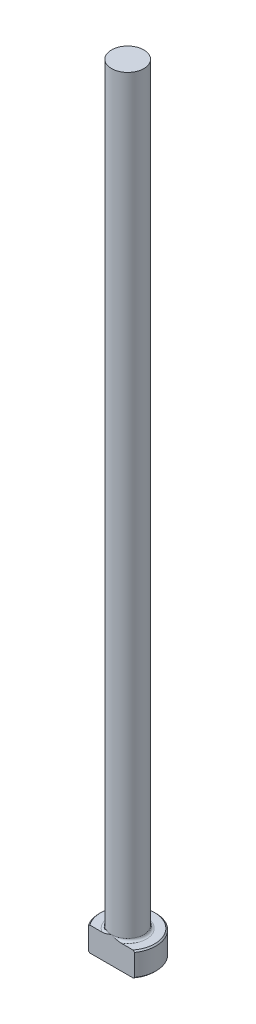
ISO-10303-21;
HEADER;
FILE_DESCRIPTION(('STEP AP214'),'2;1');
FILE_NAME('part.step','',(''),(''),'','','');
FILE_SCHEMA(('AUTOMOTIVE_DESIGN { 1 0 10303 214 1 1 1 1 }'));
ENDSEC;
DATA;
#1=APPLICATION_CONTEXT('core data for automotive mechanical design processes');
#2=APPLICATION_PROTOCOL_DEFINITION('international standard','automotive_design',2000,#1);
#3=PRODUCT_CONTEXT('',#1,'mechanical');
#4=PRODUCT('Part','Part','',(#3));
#5=PRODUCT_RELATED_PRODUCT_CATEGORY('part','',(#4));
#6=PRODUCT_DEFINITION_FORMATION('','',#4);
#7=PRODUCT_DEFINITION_CONTEXT('part definition',#1,'design');
#8=PRODUCT_DEFINITION('design','',#6,#7);
#9=PRODUCT_DEFINITION_SHAPE('','',#8);
#10=(LENGTH_UNIT() NAMED_UNIT(*) SI_UNIT(.MILLI.,.METRE.));
#11=(NAMED_UNIT(*) PLANE_ANGLE_UNIT() SI_UNIT($,.RADIAN.));
#12=(NAMED_UNIT(*) SI_UNIT($,.STERADIAN.) SOLID_ANGLE_UNIT());
#13=UNCERTAINTY_MEASURE_WITH_UNIT(LENGTH_MEASURE(1.E-05),#10,'distance_accuracy_value','');
#14=(GEOMETRIC_REPRESENTATION_CONTEXT(3) GLOBAL_UNCERTAINTY_ASSIGNED_CONTEXT((#13)) GLOBAL_UNIT_ASSIGNED_CONTEXT((#10,
#11,#12)) REPRESENTATION_CONTEXT('',''));
#15=CARTESIAN_POINT('',(0.,0.,0.));
#16=DIRECTION('',(0.,0.,1.));
#17=DIRECTION('',(1.,0.,0.));
#18=AXIS2_PLACEMENT_3D('',#15,#16,#17);
#19=CARTESIAN_POINT('',(0.,0.,0.));
#20=DIRECTION('',(0.,-1.,0.));
#21=DIRECTION('',(0.,0.,-1.));
#22=AXIS2_PLACEMENT_3D('',#19,#20,#21);
#23=PLANE('',#22);
#24=CARTESIAN_POINT('',(0.,0.,0.));
#25=DIRECTION('',(0.,-1.,0.));
#26=DIRECTION('',(0.,0.,-1.));
#27=AXIS2_PLACEMENT_3D('',#24,#25,#26);
#28=CIRCLE('',#27,5.29589999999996);
#29=CARTESIAN_POINT('',(-4.23862381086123,0.,3.17499999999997));
#30=VERTEX_POINT('',#29);
#31=CARTESIAN_POINT('',(4.23862381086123,0.,3.17499999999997));
#32=VERTEX_POINT('',#31);
#33=EDGE_CURVE('E98',#30,#32,#28,.T.);
#34=ORIENTED_EDGE('',*,*,#33,.T.);
#35=DIRECTION('',(-1.,0.,0.));
#36=VECTOR('',#35,1.);
#37=CARTESIAN_POINT('',(-4.55200670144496,0.,3.17499999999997));
#38=LINE('',#37,#36);
#39=EDGE_CURVE('E83',#32,#30,#38,.T.);
#40=ORIENTED_EDGE('',*,*,#39,.T.);
#41=EDGE_LOOP('',(#34,#40));
#42=FACE_BOUND('',#41,.T.);
#43=ADVANCED_FACE('F32',(#42),#23,.T.);
#44=CARTESIAN_POINT('',(0.,259.958771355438,0.));
#45=DIRECTION('',(0.,1.,0.));
#46=DIRECTION('',(0.,0.,1.));
#47=AXIS2_PLACEMENT_3D('',#44,#45,#46);
#48=CYLINDRICAL_SURFACE('',#47,5.54989999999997);
#49=CARTESIAN_POINT('',(0.,4.49579999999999,0.));
#50=DIRECTION('',(0.,1.,0.));
#51=DIRECTION('',(0.,0.,1.));
#52=AXIS2_PLACEMENT_3D('',#49,#50,#51);
#53=CIRCLE('',#52,5.54989999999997);
#54=CARTESIAN_POINT('',(-4.55200670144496,4.49579999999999,3.17499999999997));
#55=VERTEX_POINT('',#54);
#56=CARTESIAN_POINT('',(4.55200670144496,4.49579999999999,3.17499999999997));
#57=VERTEX_POINT('',#56);
#58=EDGE_CURVE('E104',#55,#57,#53,.F.);
#59=ORIENTED_EDGE('',*,*,#58,.T.);
#60=DIRECTION('',(0.,-1.,0.));
#61=VECTOR('',#60,1.);
#62=CARTESIAN_POINT('',(4.55200670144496,152.4,3.17499999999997));
#63=LINE('',#62,#61);
#64=CARTESIAN_POINT('',(4.55200670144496,0.253999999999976,3.17499999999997));
#65=VERTEX_POINT('',#64);
#66=EDGE_CURVE('E183',#57,#65,#63,.T.);
#67=ORIENTED_EDGE('',*,*,#66,.T.);
#68=CARTESIAN_POINT('',(0.,0.253999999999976,0.));
#69=DIRECTION('',(0.,-1.,0.));
#70=DIRECTION('',(0.,0.,-1.));
#71=AXIS2_PLACEMENT_3D('',#68,#69,#70);
#72=CIRCLE('',#71,5.54989999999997);
#73=CARTESIAN_POINT('',(-4.55200670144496,0.253999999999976,3.17499999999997));
#74=VERTEX_POINT('',#73);
#75=EDGE_CURVE('E100',#65,#74,#72,.F.);
#76=ORIENTED_EDGE('',*,*,#75,.T.);
#77=DIRECTION('',(0.,-1.,0.));
#78=VECTOR('',#77,1.);
#79=CARTESIAN_POINT('',(-4.55200670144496,152.4,3.17499999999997));
#80=LINE('',#79,#78);
#81=EDGE_CURVE('E93',#55,#74,#80,.T.);
#82=ORIENTED_EDGE('',*,*,#81,.F.);
#83=EDGE_LOOP('',(#59,#67,#76,#82));
#84=FACE_BOUND('',#83,.T.);
#85=ADVANCED_FACE('F158',(#84),#48,.T.);
#86=CARTESIAN_POINT('',(-5.54989999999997,4.7498,0.));
#87=DIRECTION('',(0.,1.,0.));
#88=DIRECTION('',(0.,0.,1.));
#89=AXIS2_PLACEMENT_3D('',#86,#87,#88);
#90=PLANE('',#89);
#91=CARTESIAN_POINT('',(0.,4.7498,0.));
#92=DIRECTION('',(0.,1.,0.));
#93=DIRECTION('',(0.,0.,1.));
#94=AXIS2_PLACEMENT_3D('',#91,#92,#93);
#95=CIRCLE('',#94,5.29589999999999);
#96=CARTESIAN_POINT('',(4.23862381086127,4.7498,3.17499999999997));
#97=VERTEX_POINT('',#96);
#98=CARTESIAN_POINT('',(-4.23862381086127,4.7498,3.17499999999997));
#99=VERTEX_POINT('',#98);
#100=EDGE_CURVE('E178',#97,#99,#95,.T.);
#101=ORIENTED_EDGE('',*,*,#100,.T.);
#102=DIRECTION('',(1.,0.,0.));
#103=VECTOR('',#102,1.);
#104=CARTESIAN_POINT('',(-5.54989999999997,4.7498,3.17499999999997));
#105=LINE('',#104,#103);
#106=CARTESIAN_POINT('',(-1.86651118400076,4.74979999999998,3.17499999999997));
#107=VERTEX_POINT('',#106);
#108=EDGE_CURVE('E57',#99,#107,#105,.T.);
#109=ORIENTED_EDGE('',*,*,#108,.T.);
#110=CARTESIAN_POINT('',(0.,4.7498,0.));
#111=DIRECTION('',(0.,1.,0.));
#112=DIRECTION('',(0.,0.,1.));
#113=AXIS2_PLACEMENT_3D('',#110,#111,#112);
#114=CIRCLE('',#113,3.68299999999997);
#115=CARTESIAN_POINT('',(1.86651118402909,4.74979999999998,3.17499999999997));
#116=VERTEX_POINT('',#115);
#117=EDGE_CURVE('E107',#107,#116,#114,.F.);
#118=ORIENTED_EDGE('',*,*,#117,.T.);
#119=EDGE_CURVE('E136',#116,#97,#105,.T.);
#120=ORIENTED_EDGE('',*,*,#119,.T.);
#121=EDGE_LOOP('',(#101,#109,#118,#120));
#122=FACE_BOUND('',#121,.T.);
#123=ADVANCED_FACE('F147',(#122),#90,.T.);
#124=CARTESIAN_POINT('',(0.,4.74980000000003,0.));
#125=DIRECTION('',(0.,-1.,0.));
#126=DIRECTION('',(0.,0.,-1.));
#127=AXIS2_PLACEMENT_3D('',#124,#125,#126);
#128=CONICAL_SURFACE('',#127,5.29589999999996,0.785398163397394);
#129=ORIENTED_EDGE('',*,*,#58,.F.);
#130=CARTESIAN_POINT('',(-10.0167402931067,-0.462188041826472,3.17499999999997));
#131=CARTESIAN_POINT('',(-9.83956615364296,-0.293299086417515,3.17499999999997));
#132=CARTESIAN_POINT('',(-9.66219175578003,-0.12462001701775,3.17499999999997));
#133=CARTESIAN_POINT('',(-9.3069644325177,0.212235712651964,3.17499999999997));
#134=CARTESIAN_POINT('',(-9.12911150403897,0.38041236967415,3.17499999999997));
#135=CARTESIAN_POINT('',(-8.59460771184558,0.884168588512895,3.17499999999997));
#136=CARTESIAN_POINT('',(-8.23712475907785,1.2188665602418,3.17499999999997));
#137=CARTESIAN_POINT('',(-7.51548848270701,1.8882077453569,3.17499999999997));
#138=CARTESIAN_POINT('',(-7.15130415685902,2.22281765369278,3.17499999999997));
#139=CARTESIAN_POINT('',(-6.60150494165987,2.72077471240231,3.17499999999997));
#140=CARTESIAN_POINT('',(-6.41766956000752,2.88608479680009,3.17499999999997));
#141=CARTESIAN_POINT('',(-6.04850874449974,3.21502923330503,3.17499999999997));
#142=CARTESIAN_POINT('',(-5.86318332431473,3.37866360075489,3.17499999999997));
#143=CARTESIAN_POINT('',(-5.42475636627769,3.76132794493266,3.17499999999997));
#144=CARTESIAN_POINT('',(-5.17087613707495,3.97947167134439,3.17499999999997));
#145=CARTESIAN_POINT('',(-4.78637219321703,4.3024257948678,3.17499999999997));
#146=CARTESIAN_POINT('',(-4.65755933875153,4.40939174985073,3.17499999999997));
#147=CARTESIAN_POINT('',(-4.39846835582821,4.62153187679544,3.17499999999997));
#148=CARTESIAN_POINT('',(-4.26819026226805,4.72670609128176,3.17499999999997));
#149=CARTESIAN_POINT('',(-4.00614386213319,4.93458819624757,3.17499999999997));
#150=CARTESIAN_POINT('',(-3.87437946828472,5.03730100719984,3.17499999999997));
#151=CARTESIAN_POINT('',(-3.60868880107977,5.23988426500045,3.17499999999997));
#152=CARTESIAN_POINT('',(-3.47476266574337,5.33975489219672,3.17499999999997));
#153=CARTESIAN_POINT('',(-3.2043256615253,5.53575009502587,3.17499999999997));
#154=CARTESIAN_POINT('',(-3.0678166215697,5.63187718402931,3.17499999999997));
#155=CARTESIAN_POINT('',(-2.7915074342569,5.81925786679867,3.17499999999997));
#156=CARTESIAN_POINT('',(-2.65170798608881,5.91051248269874,3.17499999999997));
#157=CARTESIAN_POINT('',(-2.40080357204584,6.06610461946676,3.17499999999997));
#158=CARTESIAN_POINT('',(-2.2905364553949,6.13178781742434,3.17499999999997));
#159=CARTESIAN_POINT('',(-2.06714717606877,6.2581898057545,3.17499999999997));
#160=CARTESIAN_POINT('',(-1.9540245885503,6.31890785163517,3.17499999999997));
#161=CARTESIAN_POINT('',(-1.724636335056,6.43389240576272,3.17499999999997));
#162=CARTESIAN_POINT('',(-1.60837338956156,6.48816429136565,3.17499999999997));
#163=CARTESIAN_POINT('',(-1.3723248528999,6.5884611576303,3.17499999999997));
#164=CARTESIAN_POINT('',(-1.25254039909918,6.63448876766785,3.17499999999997));
#165=CARTESIAN_POINT('',(-1.03847127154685,6.70631999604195,3.17499999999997));
#166=CARTESIAN_POINT('',(-0.944930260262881,6.73432823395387,3.17499999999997));
#167=CARTESIAN_POINT('',(-0.756011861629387,6.7832065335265,3.17499999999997));
#168=CARTESIAN_POINT('',(-0.660635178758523,6.80407927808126,3.17499999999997));
#169=CARTESIAN_POINT('',(-0.468752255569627,6.83766834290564,3.17499999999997));
#170=CARTESIAN_POINT('',(-0.37225064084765,6.85041070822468,3.17499999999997));
#171=CARTESIAN_POINT('',(-0.178484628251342,6.86715141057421,3.17499999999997));
#172=CARTESIAN_POINT('',(-0.0812202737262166,6.8711502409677,3.17499999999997));
#173=CARTESIAN_POINT('',(0.113557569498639,6.87016742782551,3.17499999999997));
#174=CARTESIAN_POINT('',(0.211070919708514,6.86515852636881,3.17499999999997));
#175=CARTESIAN_POINT('',(0.405245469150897,6.84640245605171,3.17499999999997));
#176=CARTESIAN_POINT('',(0.501906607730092,6.83265467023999,3.17499999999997));
#177=CARTESIAN_POINT('',(0.694033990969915,6.79710670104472,3.17499999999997));
#178=CARTESIAN_POINT('',(0.789495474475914,6.7752811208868,3.17499999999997));
#179=CARTESIAN_POINT('',(0.978501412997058,6.72458544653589,3.17499999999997));
#180=CARTESIAN_POINT('',(1.07204574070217,6.69571488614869,3.17499999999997));
#181=CARTESIAN_POINT('',(1.36820011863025,6.59374975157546,3.17499999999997));
#182=CARTESIAN_POINT('',(1.56688529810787,6.50918166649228,3.17499999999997));
#183=CARTESIAN_POINT('',(1.85781194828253,6.36807703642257,3.17499999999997));
#184=CARTESIAN_POINT('',(1.95370879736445,6.31860244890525,3.17499999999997));
#185=CARTESIAN_POINT('',(2.14339771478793,6.21576230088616,3.17499999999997));
#186=CARTESIAN_POINT('',(2.23719011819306,6.16239736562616,3.17499999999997));
#187=CARTESIAN_POINT('',(2.42421725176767,6.05174311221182,3.17499999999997));
#188=CARTESIAN_POINT('',(2.51742507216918,5.99440876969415,3.17499999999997));
#189=CARTESIAN_POINT('',(2.70216375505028,5.87710026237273,3.17499999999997));
#190=CARTESIAN_POINT('',(2.79369457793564,5.81712603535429,3.17499999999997));
#191=CARTESIAN_POINT('',(2.97520639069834,5.6950712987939,3.17499999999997));
#192=CARTESIAN_POINT('',(3.06518880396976,5.63299289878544,3.17499999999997));
#193=CARTESIAN_POINT('',(3.24388392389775,5.50704415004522,3.17499999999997));
#194=CARTESIAN_POINT('',(3.33259666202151,5.44317384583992,3.17499999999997));
#195=CARTESIAN_POINT('',(3.57597346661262,5.26479758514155,3.17499999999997));
#196=CARTESIAN_POINT('',(3.72948709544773,5.1487222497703,3.17499999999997));
#197=CARTESIAN_POINT('',(4.03385257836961,4.91312427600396,3.17499999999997));
#198=CARTESIAN_POINT('',(4.18470417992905,4.79360131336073,3.17499999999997));
#199=CARTESIAN_POINT('',(4.48432539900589,4.55188905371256,3.17499999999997));
#200=CARTESIAN_POINT('',(4.63309438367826,4.42969897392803,3.17499999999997));
#201=CARTESIAN_POINT('',(4.92891951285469,4.18325994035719,3.17499999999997));
#202=CARTESIAN_POINT('',(5.07597561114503,4.05901093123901,3.17499999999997));
#203=CARTESIAN_POINT('',(5.51556942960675,3.68340723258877,3.17499999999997));
#204=CARTESIAN_POINT('',(5.80602157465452,3.42961335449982,3.17499999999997));
#205=CARTESIAN_POINT('',(6.38307996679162,2.91781719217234,3.17499999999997));
#206=CARTESIAN_POINT('',(6.66968688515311,2.65981566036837,3.17499999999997));
#207=CARTESIAN_POINT('',(7.2137512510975,2.16488107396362,3.17499999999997));
#208=CARTESIAN_POINT('',(7.47144859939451,1.92821133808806,3.17499999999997));
#209=CARTESIAN_POINT('',(7.98516371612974,1.45303114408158,3.17499999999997));
#210=CARTESIAN_POINT('',(8.24118139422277,1.2145205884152,3.17499999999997));
#211=CARTESIAN_POINT('',(8.75104638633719,0.736915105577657,3.17499999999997));
#212=CARTESIAN_POINT('',(9.00489811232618,0.497824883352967,3.17499999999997));
#213=CARTESIAN_POINT('',(9.51154344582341,0.0185627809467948,3.17499999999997));
#214=CARTESIAN_POINT('',(9.76433712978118,-0.221609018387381,3.17499999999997));
#215=CARTESIAN_POINT('',(10.0167402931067,-0.462188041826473,3.17499999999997));
#216=B_SPLINE_CURVE_WITH_KNOTS('',3,(#130,#131,#132,#133,#134,#135,#136,#137,#138,#139,#140,
#141,#142,#143,#144,#145,#146,#147,#148,#149,#150,#151,#152,#153,#154,#155,#156,#157,#158,#159,
#160,#161,#162,#163,#164,#165,#166,#167,#168,#169,#170,#171,#172,#173,#174,#175,#176,#177,#178,
#179,#180,#181,#182,#183,#184,#185,#186,#187,#188,#189,#190,#191,#192,#193,#194,#195,#196,#197,
#198,#199,#200,#201,#202,#203,#204,#205,#206,#207,#208,#209,#210,#211,#212,#213,#214,#215),
.UNSPECIFIED.,.F.,.F.,(4,2,2,2,2,2,2,2,2,2,2,2,2,2,2,2,2,2,2,2,2,2,2,2,2,2,2,2,2,2,2,2,2,2,2,2,
2,2,2,2,2,2,4),(0.,0.734320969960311,1.46864667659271,2.93776649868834,4.42142163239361,
5.16310419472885,5.90477996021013,6.90888979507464,7.41118265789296,7.9134635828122,
8.41463858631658,8.91578171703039,9.41658237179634,9.91727755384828,10.3022224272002,
10.68722491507,11.0719039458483,11.4564600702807,11.7491569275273,12.0417436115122,
12.3333882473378,12.6250164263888,12.9175285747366,13.2100613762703,13.5035218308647,
13.797001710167,14.4429112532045,14.7666018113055,15.0902404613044,15.4184826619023,
15.7467326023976,16.0746626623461,16.4025845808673,16.9798839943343,17.5572378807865,
18.1347635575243,18.7123047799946,19.8693665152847,21.0262235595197,22.0758708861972,
23.1255742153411,24.1717271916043,25.2178032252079),.UNSPECIFIED.);
#217=EDGE_CURVE('E135',#55,#99,#216,.T.);
#218=ORIENTED_EDGE('',*,*,#217,.T.);
#219=ORIENTED_EDGE('',*,*,#100,.F.);
#220=EDGE_CURVE('E127',#97,#57,#216,.T.);
#221=ORIENTED_EDGE('',*,*,#220,.T.);
#222=EDGE_LOOP('',(#129,#218,#219,#221));
#223=FACE_BOUND('',#222,.T.);
#224=ADVANCED_FACE('F143',(#223),#128,.T.);
#225=CARTESIAN_POINT('',(0.,0.253999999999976,0.));
#226=DIRECTION('',(0.,1.,0.));
#227=DIRECTION('',(0.,0.,1.));
#228=AXIS2_PLACEMENT_3D('',#225,#226,#227);
#229=CONICAL_SURFACE('',#228,5.54989999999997,0.785398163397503);
#230=ORIENTED_EDGE('',*,*,#75,.F.);
#231=CARTESIAN_POINT('',(10.0167402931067,5.21198804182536,3.17499999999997));
#232=CARTESIAN_POINT('',(9.83956615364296,5.04309908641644,3.17499999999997));
#233=CARTESIAN_POINT('',(9.66219175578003,4.87442001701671,3.17499999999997));
#234=CARTESIAN_POINT('',(9.3069644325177,4.53756428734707,3.17499999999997));
#235=CARTESIAN_POINT('',(9.12911150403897,4.36938763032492,3.17499999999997));
#236=CARTESIAN_POINT('',(8.59460771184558,3.86563141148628,3.17499999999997));
#237=CARTESIAN_POINT('',(8.23712475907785,3.53093343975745,3.17499999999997));
#238=CARTESIAN_POINT('',(7.515488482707,2.8615922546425,3.17499999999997));
#239=CARTESIAN_POINT('',(7.15130415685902,2.5269823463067,3.17499999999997));
#240=CARTESIAN_POINT('',(6.60150494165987,2.02902528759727,3.17499999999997));
#241=CARTESIAN_POINT('',(6.41766956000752,1.86371520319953,3.17499999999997));
#242=CARTESIAN_POINT('',(6.04850874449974,1.53477076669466,3.17499999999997));
#243=CARTESIAN_POINT('',(5.86318332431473,1.37113639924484,3.17499999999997));
#244=CARTESIAN_POINT('',(5.42475636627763,0.988472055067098,3.17499999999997));
#245=CARTESIAN_POINT('',(5.17087613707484,0.770328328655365,3.17499999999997));
#246=CARTESIAN_POINT('',(4.78637219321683,0.447374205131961,3.17499999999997));
#247=CARTESIAN_POINT('',(4.65755933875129,0.340408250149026,3.17499999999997));
#248=CARTESIAN_POINT('',(4.39846835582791,0.128268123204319,3.17499999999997));
#249=CARTESIAN_POINT('',(4.26819026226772,0.0230939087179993,3.17499999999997));
#250=CARTESIAN_POINT('',(4.0061438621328,-0.184788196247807,3.17499999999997));
#251=CARTESIAN_POINT('',(3.8743794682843,-0.287501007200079,3.17499999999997));
#252=CARTESIAN_POINT('',(3.60868880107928,-0.490084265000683,3.17499999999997));
#253=CARTESIAN_POINT('',(3.47476266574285,-0.589954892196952,3.17499999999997));
#254=CARTESIAN_POINT('',(3.20432566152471,-0.785950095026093,3.17499999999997));
#255=CARTESIAN_POINT('',(3.06781662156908,-0.882077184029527,3.17499999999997));
#256=CARTESIAN_POINT('',(2.79150743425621,-1.06945786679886,3.17499999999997));
#257=CARTESIAN_POINT('',(2.65170798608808,-1.16071248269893,3.17499999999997));
#258=CARTESIAN_POINT('',(2.40080357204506,-1.31630461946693,3.17499999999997));
#259=CARTESIAN_POINT('',(2.29053645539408,-1.38198781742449,3.17499999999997));
#260=CARTESIAN_POINT('',(2.0671471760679,-1.50838980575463,3.17499999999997));
#261=CARTESIAN_POINT('',(1.95402458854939,-1.56910785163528,3.17499999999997));
#262=CARTESIAN_POINT('',(1.72463633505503,-1.68409240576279,3.17499999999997));
#263=CARTESIAN_POINT('',(1.60837338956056,-1.7383642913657,3.17499999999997));
#264=CARTESIAN_POINT('',(1.37232485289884,-1.83866115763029,3.17499999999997));
#265=CARTESIAN_POINT('',(1.25254039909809,-1.88468876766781,3.17499999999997));
#266=CARTESIAN_POINT('',(1.03847127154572,-1.95651999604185,3.17499999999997));
#267=CARTESIAN_POINT('',(0.944930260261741,-1.98452823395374,3.17499999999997));
#268=CARTESIAN_POINT('',(0.756011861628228,-2.0334065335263,3.17499999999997));
#269=CARTESIAN_POINT('',(0.660635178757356,-2.05427927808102,3.17499999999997));
#270=CARTESIAN_POINT('',(0.468752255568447,-2.08786834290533,3.17499999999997));
#271=CARTESIAN_POINT('',(0.372250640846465,-2.10061070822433,3.17499999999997));
#272=CARTESIAN_POINT('',(0.178484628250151,-2.11735141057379,3.17499999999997));
#273=CARTESIAN_POINT('',(0.0812202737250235,-2.12135024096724,3.17499999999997));
#274=CARTESIAN_POINT('',(-0.113557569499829,-2.12036742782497,3.17499999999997));
#275=CARTESIAN_POINT('',(-0.2110709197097,-2.11535852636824,3.17499999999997));
#276=CARTESIAN_POINT('',(-0.405245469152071,-2.09660245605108,3.17499999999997));
#277=CARTESIAN_POINT('',(-0.50190660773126,-2.08285467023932,3.17499999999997));
#278=CARTESIAN_POINT('',(-0.694033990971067,-2.047306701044,3.17499999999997));
#279=CARTESIAN_POINT('',(-0.789495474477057,-2.02548112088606,3.17499999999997));
#280=CARTESIAN_POINT('',(-0.978501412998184,-1.9747854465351,3.17499999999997));
#281=CARTESIAN_POINT('',(-1.07204574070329,-1.94591488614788,3.17499999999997));
#282=CARTESIAN_POINT('',(-1.36820011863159,-1.84394975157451,3.17499999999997));
#283=CARTESIAN_POINT('',(-1.56688529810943,-1.75938166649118,3.17499999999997));
#284=CARTESIAN_POINT('',(-1.85781194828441,-1.61827703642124,3.17499999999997));
#285=CARTESIAN_POINT('',(-1.95370879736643,-1.56880244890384,3.17499999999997));
#286=CARTESIAN_POINT('',(-2.14339771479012,-1.46596230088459,3.17499999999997));
#287=CARTESIAN_POINT('',(-2.23719011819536,-1.41259736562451,3.17499999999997));
#288=CARTESIAN_POINT('',(-2.42421725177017,-1.30194311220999,3.17499999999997));
#289=CARTESIAN_POINT('',(-2.51742507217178,-1.24460876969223,3.17499999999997));
#290=CARTESIAN_POINT('',(-2.70216375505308,-1.12730026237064,3.17499999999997));
#291=CARTESIAN_POINT('',(-2.79369457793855,-1.06732603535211,3.17499999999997));
#292=CARTESIAN_POINT('',(-2.97520639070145,-0.945271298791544,3.17499999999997));
#293=CARTESIAN_POINT('',(-3.06518880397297,-0.883192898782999,3.17499999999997));
#294=CARTESIAN_POINT('',(-3.24388392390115,-0.757244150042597,3.17499999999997));
#295=CARTESIAN_POINT('',(-3.33259666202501,-0.69337384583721,3.17499999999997));
#296=CARTESIAN_POINT('',(-3.57597346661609,-0.514997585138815,3.17499999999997));
#297=CARTESIAN_POINT('',(-3.72948709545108,-0.398922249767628,3.17499999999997));
#298=CARTESIAN_POINT('',(-4.03385257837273,-0.16332427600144,3.17499999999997));
#299=CARTESIAN_POINT('',(-4.18470417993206,-0.0438013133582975,3.17499999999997));
#300=CARTESIAN_POINT('',(-4.48432539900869,0.197910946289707,3.17499999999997));
#301=CARTESIAN_POINT('',(-4.63309438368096,0.320101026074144,3.17499999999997));
#302=CARTESIAN_POINT('',(-4.92891951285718,0.566540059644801,3.17499999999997));
#303=CARTESIAN_POINT('',(-5.07597561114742,0.690789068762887,3.17499999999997));
#304=CARTESIAN_POINT('',(-5.51556942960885,1.06639276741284,3.17499999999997));
#305=CARTESIAN_POINT('',(-5.80602157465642,1.32018664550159,3.17499999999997));
#306=CARTESIAN_POINT('',(-6.38307996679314,1.83198280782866,3.17499999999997));
#307=CARTESIAN_POINT('',(-6.66968688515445,2.08998433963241,3.17499999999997));
#308=CARTESIAN_POINT('',(-7.21375125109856,2.58491892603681,3.17499999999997));
#309=CARTESIAN_POINT('',(-7.47144859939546,2.82158866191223,3.17499999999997));
#310=CARTESIAN_POINT('',(-7.9851637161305,3.29676885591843,3.17499999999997));
#311=CARTESIAN_POINT('',(-8.24118139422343,3.53527941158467,3.17499999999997));
#312=CARTESIAN_POINT('',(-8.75104638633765,4.01288489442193,3.17499999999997));
#313=CARTESIAN_POINT('',(-9.00489811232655,4.25197511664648,3.17499999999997));
#314=CARTESIAN_POINT('',(-9.51154344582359,4.73123721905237,3.17499999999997));
#315=CARTESIAN_POINT('',(-9.76433712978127,4.97140901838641,3.17499999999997));
#316=CARTESIAN_POINT('',(-10.0167402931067,5.21198804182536,3.17499999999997));
#317=B_SPLINE_CURVE_WITH_KNOTS('',3,(#231,#232,#233,#234,#235,#236,#237,#238,#239,#240,#241,
#242,#243,#244,#245,#246,#247,#248,#249,#250,#251,#252,#253,#254,#255,#256,#257,#258,#259,#260,
#261,#262,#263,#264,#265,#266,#267,#268,#269,#270,#271,#272,#273,#274,#275,#276,#277,#278,#279,
#280,#281,#282,#283,#284,#285,#286,#287,#288,#289,#290,#291,#292,#293,#294,#295,#296,#297,#298,
#299,#300,#301,#302,#303,#304,#305,#306,#307,#308,#309,#310,#311,#312,#313,#314,#315,#316),
.UNSPECIFIED.,.F.,.F.,(4,2,2,2,2,2,2,2,2,2,2,2,2,2,2,2,2,2,2,2,2,2,2,2,2,2,2,2,2,2,2,2,2,2,2,2,
2,2,2,2,2,2,4),(0.,0.734320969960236,1.46864667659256,2.93776649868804,4.42142163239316,
5.16310419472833,5.90477996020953,6.90888979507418,7.41118265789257,7.91346358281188,
8.41463858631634,8.91578171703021,9.41658237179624,9.91727755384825,10.3022224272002,
10.68722491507,11.0719039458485,11.4564600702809,11.7491569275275,12.0417436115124,
12.333388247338,12.625016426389,12.9175285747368,13.2100613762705,13.5035218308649,
13.7970017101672,14.4429112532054,14.7666018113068,15.0902404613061,15.4184826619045,
15.7467326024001,16.074662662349,16.4025845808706,16.9798839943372,17.557237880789,
18.1347635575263,18.7123047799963,19.8693665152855,21.0262235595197,22.0758708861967,
23.12557421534,24.1717271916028,25.2178032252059),.UNSPECIFIED.);
#318=EDGE_CURVE('E86',#65,#32,#317,.T.);
#319=ORIENTED_EDGE('',*,*,#318,.T.);
#320=ORIENTED_EDGE('',*,*,#33,.F.);
#321=EDGE_CURVE('E89',#30,#74,#317,.T.);
#322=ORIENTED_EDGE('',*,*,#321,.T.);
#323=EDGE_LOOP('',(#230,#319,#320,#322));
#324=FACE_BOUND('',#323,.T.);
#325=ADVANCED_FACE('F97',(#324),#229,.T.);
#326=CARTESIAN_POINT('',(0.,5.25779999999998,0.));
#327=DIRECTION('',(0.,1.,0.));
#328=DIRECTION('',(0.,0.,1.));
#329=AXIS2_PLACEMENT_3D('',#326,#327,#328);
#330=TOROIDAL_SURFACE('',#329,3.68299999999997,0.508);
#331=CARTESIAN_POINT('',(0.,5.25779999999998,3.17499999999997));
#332=CARTESIAN_POINT('',(1.80769140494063E-10,5.25780081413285,3.17499999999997));
#333=CARTESIAN_POINT('',(1.73023885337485E-07,5.25780162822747,3.17499999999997));
#334=CARTESIAN_POINT('',(7.19628532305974E-07,5.25780319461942,3.17499999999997));
#335=CARTESIAN_POINT('',(1.09883574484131E-06,5.25780394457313,3.17499999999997));
#336=CARTESIAN_POINT('',(2.00966877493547E-06,5.25780544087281,3.17499999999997));
#337=CARTESIAN_POINT('',(2.55212989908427E-06,5.25780618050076,3.17499999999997));
#338=CARTESIAN_POINT('',(3.72136332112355E-06,5.2578075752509,3.17499999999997));
#339=CARTESIAN_POINT('',(4.34736599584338E-06,5.25780823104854,3.17499999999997));
#340=CARTESIAN_POINT('',(6.59438228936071E-06,5.25781043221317,3.17499999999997));
#341=CARTESIAN_POINT('',(8.32481537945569E-06,5.25781186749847,3.17499999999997));
#342=CARTESIAN_POINT('',(1.18988287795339E-05,5.25781442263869,3.17499999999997));
#343=CARTESIAN_POINT('',(1.37358815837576E-05,5.25781555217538,3.17499999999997));
#344=CARTESIAN_POINT('',(2.09135299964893E-05,5.25781980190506,3.17499999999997));
#345=CARTESIAN_POINT('',(2.6391246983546E-05,5.25782270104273,3.17499999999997));
#346=CARTESIAN_POINT('',(3.71867761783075E-05,5.25782743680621,3.17499999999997));
#347=CARTESIAN_POINT('',(4.2473661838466E-05,5.25782934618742,3.17499999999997));
#348=CARTESIAN_POINT('',(6.50188365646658E-05,5.25783746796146,3.17499999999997));
#349=CARTESIAN_POINT('',(8.22815780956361E-05,5.25784363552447,3.17499999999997));
#350=CARTESIAN_POINT('',(0.000114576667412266,5.25785352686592,3.17499999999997));
#351=CARTESIAN_POINT('',(0.000129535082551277,5.25785748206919,3.17499999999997));
#352=CARTESIAN_POINT('',(0.000238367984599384,5.25788883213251,3.17499999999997));
#353=CARTESIAN_POINT('',(0.00032805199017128,5.25792882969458,3.17499999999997));
#354=CARTESIAN_POINT('',(0.000676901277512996,5.25807871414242,3.17499999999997));
#355=CARTESIAN_POINT('',(0.000938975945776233,5.25817923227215,3.17499999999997));
#356=CARTESIAN_POINT('',(0.00195700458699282,5.25857549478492,3.17499999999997));
#357=CARTESIAN_POINT('',(0.00270997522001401,5.25888105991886,3.17499999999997));
#358=CARTESIAN_POINT('',(0.00579427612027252,5.26012678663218,3.17499999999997));
#359=CARTESIAN_POINT('',(0.00812889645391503,5.26105588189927,3.17499999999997));
#360=CARTESIAN_POINT('',(0.0536737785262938,5.27918868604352,3.17499999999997));
#361=CARTESIAN_POINT('',(0.0968493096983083,5.29651116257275,3.17499999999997));
#362=CARTESIAN_POINT('',(0.181675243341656,5.33030366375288,3.17499999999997));
#363=CARTESIAN_POINT('',(0.223322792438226,5.34678146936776,3.17499999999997));
#364=CARTESIAN_POINT('',(0.311600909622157,5.38141206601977,3.17499999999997));
#365=CARTESIAN_POINT('',(0.358243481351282,5.39953485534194,3.17499999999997));
#366=CARTESIAN_POINT('',(0.452199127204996,5.43546002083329,3.17499999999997));
#367=CARTESIAN_POINT('',(0.499514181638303,5.45325722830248,3.17499999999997));
#368=CARTESIAN_POINT('',(0.58191514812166,5.48356219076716,3.17499999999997));
#369=CARTESIAN_POINT('',(0.616942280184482,5.49622931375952,3.17499999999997));
#370=CARTESIAN_POINT('',(0.687074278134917,5.52107238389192,3.17499999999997));
#371=CARTESIAN_POINT('',(0.722178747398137,5.53324945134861,3.17499999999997));
#372=CARTESIAN_POINT('',(0.826178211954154,5.56842938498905,3.17499999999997));
#373=CARTESIAN_POINT('',(0.895335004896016,5.59066808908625,3.17499999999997));
#374=CARTESIAN_POINT('',(1.04440355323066,5.63534989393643,3.17499999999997));
#375=CARTESIAN_POINT('',(1.12444395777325,5.65737079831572,3.17499999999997));
#376=CARTESIAN_POINT('',(1.28636529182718,5.69671209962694,3.17499999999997));
#377=CARTESIAN_POINT('',(1.36825573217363,5.71399428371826,3.17499999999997));
#378=CARTESIAN_POINT('',(1.53827501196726,5.74289044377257,3.17499999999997));
#379=CARTESIAN_POINT('',(1.6264772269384,5.754089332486,3.17499999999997));
#380=CARTESIAN_POINT('',(1.80336979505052,5.766538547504,3.17499999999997));
#381=CARTESIAN_POINT('',(1.89205668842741,5.76782927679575,3.17499999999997));
#382=CARTESIAN_POINT('',(2.04614946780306,5.75829207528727,3.17499999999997));
#383=CARTESIAN_POINT('',(2.1117267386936,5.7504696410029,3.17499999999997));
#384=CARTESIAN_POINT('',(2.24032569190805,5.72527330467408,3.17499999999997));
#385=CARTESIAN_POINT('',(2.30336992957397,5.70802985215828,3.17499999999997));
#386=CARTESIAN_POINT('',(2.3964725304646,5.67213651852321,3.17499999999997));
#387=CARTESIAN_POINT('',(2.42822079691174,5.65788049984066,3.17499999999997));
#388=CARTESIAN_POINT('',(2.48965433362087,5.62525897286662,3.17499999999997));
#389=CARTESIAN_POINT('',(2.51933677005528,5.60688795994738,3.17499999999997));
#390=CARTESIAN_POINT('',(2.56994777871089,5.56951032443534,3.17499999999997));
#391=CARTESIAN_POINT('',(2.59146237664,5.55130442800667,3.17499999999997));
#392=CARTESIAN_POINT('',(2.63132394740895,5.5117021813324,3.17499999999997));
#393=CARTESIAN_POINT('',(2.64967743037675,5.49031256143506,3.17499999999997));
#394=CARTESIAN_POINT('',(2.67804602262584,5.4500327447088,3.17499999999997));
#395=CARTESIAN_POINT('',(2.6890027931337,5.43180880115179,3.17499999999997));
#396=CARTESIAN_POINT('',(2.7078017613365,5.3938065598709,3.17499999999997));
#397=CARTESIAN_POINT('',(2.71564587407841,5.37402922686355,3.17499999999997));
#398=CARTESIAN_POINT('',(2.72769754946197,5.33322214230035,3.17499999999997));
#399=CARTESIAN_POINT('',(2.73187843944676,5.31218437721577,3.17499999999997));
#400=CARTESIAN_POINT('',(2.73613267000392,5.26969745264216,3.17499999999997));
#401=CARTESIAN_POINT('',(2.73620805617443,5.24824850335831,3.17499999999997));
#402=CARTESIAN_POINT('',(2.73247730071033,5.20813635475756,3.17499999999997));
#403=CARTESIAN_POINT('',(2.72910595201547,5.18943073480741,3.17499999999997));
#404=CARTESIAN_POINT('',(2.71937153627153,5.15282145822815,3.17499999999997));
#405=CARTESIAN_POINT('',(2.71300800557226,5.13491792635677,3.17499999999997));
#406=CARTESIAN_POINT('',(2.69740230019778,5.0996670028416,3.17499999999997));
#407=CARTESIAN_POINT('',(2.68806645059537,5.08236154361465,3.17499999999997));
#408=CARTESIAN_POINT('',(2.66708571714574,5.04922644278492,3.17499999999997));
#409=CARTESIAN_POINT('',(2.65543987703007,5.03339741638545,3.17499999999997));
#410=CARTESIAN_POINT('',(2.62294588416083,4.99450310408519,3.17499999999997));
#411=CARTESIAN_POINT('',(2.60069446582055,4.9726078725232,3.17499999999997));
#412=CARTESIAN_POINT('',(2.55299669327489,4.93259922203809,3.17499999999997));
#413=CARTESIAN_POINT('',(2.52754047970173,4.91449795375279,3.17499999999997));
#414=CARTESIAN_POINT('',(2.46015073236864,4.87290115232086,3.17499999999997));
#415=CARTESIAN_POINT('',(2.41675555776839,4.85178783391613,3.17499999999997));
#416=CARTESIAN_POINT('',(2.32743780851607,4.81642640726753,3.17499999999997));
#417=CARTESIAN_POINT('',(2.28151740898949,4.80217249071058,3.17499999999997));
#418=CARTESIAN_POINT('',(2.19492730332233,4.78086425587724,3.17499999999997));
#419=CARTESIAN_POINT('',(2.15443153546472,4.77307762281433,3.17499999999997));
#420=CARTESIAN_POINT('',(2.07290577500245,4.7609987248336,3.17499999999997));
#421=CARTESIAN_POINT('',(2.03187536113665,4.75670940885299,3.17499999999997));
#422=CARTESIAN_POINT('',(1.90717655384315,4.74822293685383,3.17499999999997));
#423=CARTESIAN_POINT('',(1.82319261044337,4.74868666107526,3.17499999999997));
#424=CARTESIAN_POINT('',(1.62833175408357,4.76032593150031,3.17499999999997));
#425=CARTESIAN_POINT('',(1.51770881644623,4.77497959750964,3.17499999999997));
#426=CARTESIAN_POINT('',(1.29813873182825,4.81534590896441,3.17499999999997));
#427=CARTESIAN_POINT('',(1.18920134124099,4.84110792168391,3.17499999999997));
#428=CARTESIAN_POINT('',(0.982215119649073,4.89780610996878,3.17499999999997));
#429=CARTESIAN_POINT('',(0.883999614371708,4.92815337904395,3.17499999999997));
#430=CARTESIAN_POINT('',(0.689996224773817,4.99284004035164,3.17499999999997));
#431=CARTESIAN_POINT('',(0.594193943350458,5.02713703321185,3.17499999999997));
#432=CARTESIAN_POINT('',(0.464142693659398,5.07567249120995,3.17499999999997));
#433=CARTESIAN_POINT('',(0.429471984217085,5.08880513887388,3.17499999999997));
#434=CARTESIAN_POINT('',(0.359331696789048,5.11568278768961,3.17499999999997));
#435=CARTESIAN_POINT('',(0.323864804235,5.1294348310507,3.17499999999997));
#436=CARTESIAN_POINT('',(0.263992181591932,5.15284621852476,3.17499999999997));
#437=CARTESIAN_POINT('',(0.239565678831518,5.16245280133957,3.17499999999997));
#438=CARTESIAN_POINT('',(0.190982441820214,5.18164529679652,3.17499999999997));
#439=CARTESIAN_POINT('',(0.166825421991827,5.19123047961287,3.17499999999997));
#440=CARTESIAN_POINT('',(0.121037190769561,5.20943918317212,3.17499999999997));
#441=CARTESIAN_POINT('',(0.0994044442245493,5.21805909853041,3.17499999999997));
#442=CARTESIAN_POINT('',(0.0553410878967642,5.23567638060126,3.17499999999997));
#443=CARTESIAN_POINT('',(0.0329111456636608,5.24467572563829,3.17499999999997));
#444=CARTESIAN_POINT('',(0.00813211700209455,5.25454302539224,3.17499999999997));
#445=CARTESIAN_POINT('',(0.00580062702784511,5.2554707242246,3.17499999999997));
#446=CARTESIAN_POINT('',(0.00271708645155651,5.25671609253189,3.17499999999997));
#447=CARTESIAN_POINT('',(0.00196172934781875,5.25702263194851,3.17499999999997));
#448=CARTESIAN_POINT('',(0.000940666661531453,5.25742007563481,3.17499999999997));
#449=CARTESIAN_POINT('',(0.000677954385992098,5.25752083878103,3.17499999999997));
#450=CARTESIAN_POINT('',(0.000328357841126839,5.25767104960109,3.17499999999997));
#451=CARTESIAN_POINT('',(0.000238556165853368,5.25771109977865,3.17499999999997));
#452=CARTESIAN_POINT('',(0.000129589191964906,5.25774247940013,3.17499999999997));
#453=CARTESIAN_POINT('',(0.000114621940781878,5.25774643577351,3.17499999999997));
#454=CARTESIAN_POINT('',(8.23074123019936E-05,5.25775633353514,3.17499999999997));
#455=CARTESIAN_POINT('',(6.50343068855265E-05,5.2577625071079,3.17499999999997));
#456=CARTESIAN_POINT('',(4.24775013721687E-05,5.25777063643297,3.17499999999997));
#457=CARTESIAN_POINT('',(3.71892385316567E-05,5.25777254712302,3.17499999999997));
#458=CARTESIAN_POINT('',(2.63911144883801E-05,5.25777728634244,3.17499999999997));
#459=CARTESIAN_POINT('',(2.09122302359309E-05,5.25778018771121,3.17499999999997));
#460=CARTESIAN_POINT('',(1.37334834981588E-05,5.25778444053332,3.17499999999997));
#461=CARTESIAN_POINT('',(1.18963230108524E-05,5.25778557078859,3.17499999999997));
#462=CARTESIAN_POINT('',(8.32223669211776E-06,5.25778812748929,3.17499999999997));
#463=CARTESIAN_POINT('',(6.59184566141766E-06,5.25778956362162,3.17499999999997));
#464=CARTESIAN_POINT('',(4.34505756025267E-06,5.25779176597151,3.17499999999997));
#465=CARTESIAN_POINT('',(3.71915459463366E-06,5.25779242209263,3.17499999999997));
#466=CARTESIAN_POINT('',(2.55017853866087E-06,5.25779381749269,3.17499999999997));
#467=CARTESIAN_POINT('',(2.00787573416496E-06,5.25779455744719,3.17499999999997));
#468=CARTESIAN_POINT('',(1.09742559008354E-06,5.25779605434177,3.17499999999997));
#469=CARTESIAN_POINT('',(7.18435040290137E-07,5.2577968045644,3.17499999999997));
#470=CARTESIAN_POINT('',(1.72356606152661E-07,5.25779837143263,3.17499999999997));
#471=CARTESIAN_POINT('',(-1.80798377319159E-10,5.25779918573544,3.17499999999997));
#472=CARTESIAN_POINT('',(0.,5.25779999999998,3.17499999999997));
#473=B_SPLINE_CURVE_WITH_KNOTS('',3,(#331,#332,#333,#334,#335,#336,#337,#338,#339,#340,#341,
#342,#343,#344,#345,#346,#347,#348,#349,#350,#351,#352,#353,#354,#355,#356,#357,#358,#359,#360,
#361,#362,#363,#364,#365,#366,#367,#368,#369,#370,#371,#372,#373,#374,#375,#376,#377,#378,#379,
#380,#381,#382,#383,#384,#385,#386,#387,#388,#389,#390,#391,#392,#393,#394,#395,#396,#397,#398,
#399,#400,#401,#402,#403,#404,#405,#406,#407,#408,#409,#410,#411,#412,#413,#414,#415,#416,#417,
#418,#419,#420,#421,#422,#423,#424,#425,#426,#427,#428,#429,#430,#431,#432,#433,#434,#435,#436,
#437,#438,#439,#440,#441,#442,#443,#444,#445,#446,#447,#448,#449,#450,#451,#452,#453,#454,#455,
#456,#457,#458,#459,#460,#461,#462,#463,#464,#465,#466,#467,#468,#469,#470,#471,#472),
.UNSPECIFIED.,.T.,.F.,(4,2,2,2,2,2,2,2,2,2,2,2,2,2,2,2,2,2,2,2,2,2,2,2,2,2,2,2,2,2,2,2,2,2,2,2,
2,2,2,2,2,2,2,2,2,2,2,2,2,2,2,2,2,2,2,2,2,2,2,2,2,2,2,2,2,2,2,2,2,2,4),(0.,2.44115443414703E-06,
4.95009295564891E-06,7.69053483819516E-06,1.04072794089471E-05,1.71193004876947E-05,
2.35837539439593E-05,4.21184943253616E-05,5.89639869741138E-05,0.000113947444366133,
0.000160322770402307,0.000453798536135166,0.00129678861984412,0.00373346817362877,
0.011272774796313,0.150820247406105,0.285189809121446,0.435305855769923,0.586956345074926,
0.698695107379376,0.810161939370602,1.02805278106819,1.2769837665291,1.52786673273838,
1.79421526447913,2.05947711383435,2.25711645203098,2.45208605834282,2.55626736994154,
2.66058888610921,2.74486087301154,2.82895717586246,2.89250582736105,2.95601532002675,
3.01998348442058,3.08391977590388,3.14067853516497,3.19744609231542,3.25621727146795,
3.31501283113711,3.40813164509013,3.50154427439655,3.64551034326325,3.78935429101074,
3.91289118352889,4.03653213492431,4.28773663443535,4.62168697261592,4.95713698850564,
5.26538775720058,5.57059335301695,5.68181719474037,5.79593491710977,5.87467803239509,
5.95264488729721,6.02250735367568,6.09500368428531,6.10253275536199,6.10497716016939,
6.10582220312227,6.10611606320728,6.10616246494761,6.10621748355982,6.10623433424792,
6.10625287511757,6.10625934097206,6.10626605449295,6.10626877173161,6.10627151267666,
6.10627402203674,6.106276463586),.UNSPECIFIED.);
#474=CARTESIAN_POINT('',(0.,5.25779999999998,3.17499999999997));
#475=VERTEX_POINT('',#474);
#476=EDGE_CURVE('E11',#116,#475,#473,.T.);
#477=ORIENTED_EDGE('',*,*,#476,.F.);
#478=ORIENTED_EDGE('',*,*,#117,.F.);
#479=CARTESIAN_POINT('',(0.,5.25779999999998,3.17499999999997));
#480=CARTESIAN_POINT('',(-1.80769045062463E-10,5.25779918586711,3.17499999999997));
#481=CARTESIAN_POINT('',(-1.73023885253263E-07,5.25779837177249,3.17499999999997));
#482=CARTESIAN_POINT('',(-7.19628532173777E-07,5.25779680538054,3.17499999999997));
#483=CARTESIAN_POINT('',(-1.09883574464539E-06,5.25779605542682,3.17499999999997));
#484=CARTESIAN_POINT('',(-2.009668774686E-06,5.25779455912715,3.17499999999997));
#485=CARTESIAN_POINT('',(-2.55212989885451E-06,5.2577938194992,3.17499999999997));
#486=CARTESIAN_POINT('',(-3.72136332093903E-06,5.25779242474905,3.17499999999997));
#487=CARTESIAN_POINT('',(-4.34736599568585E-06,5.25779176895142,3.17499999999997));
#488=CARTESIAN_POINT('',(-6.59438228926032E-06,5.25778956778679,3.17499999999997));
#489=CARTESIAN_POINT('',(-8.32481537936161E-06,5.25778813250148,3.17499999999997));
#490=CARTESIAN_POINT('',(-1.18988287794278E-05,5.25778557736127,3.17499999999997));
#491=CARTESIAN_POINT('',(-1.37358815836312E-05,5.25778444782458,3.17499999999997));
#492=CARTESIAN_POINT('',(-2.09135299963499E-05,5.2577801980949,3.17499999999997));
#493=CARTESIAN_POINT('',(-2.63912469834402E-05,5.25777729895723,3.17499999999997));
#494=CARTESIAN_POINT('',(-3.71867761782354E-05,5.25777256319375,3.17499999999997));
#495=CARTESIAN_POINT('',(-4.24736618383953E-05,5.25777065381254,3.17499999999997));
#496=CARTESIAN_POINT('',(-6.50188365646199E-05,5.25776253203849,3.17499999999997));
#497=CARTESIAN_POINT('',(-8.22815780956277E-05,5.25775636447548,3.17499999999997));
#498=CARTESIAN_POINT('',(-0.000114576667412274,5.25774647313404,3.17499999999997));
#499=CARTESIAN_POINT('',(-0.000129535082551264,5.25774251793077,3.17499999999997));
#500=CARTESIAN_POINT('',(-0.000238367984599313,5.25771116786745,3.17499999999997));
#501=CARTESIAN_POINT('',(-0.000328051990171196,5.25767117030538,3.17499999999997));
#502=CARTESIAN_POINT('',(-0.000676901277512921,5.25752128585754,3.17499999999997));
#503=CARTESIAN_POINT('',(-0.000938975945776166,5.25742076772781,3.17499999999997));
#504=CARTESIAN_POINT('',(-0.00195700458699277,5.25702450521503,3.17499999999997));
#505=CARTESIAN_POINT('',(-0.00270997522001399,5.2567189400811,3.17499999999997));
#506=CARTESIAN_POINT('',(-0.00579427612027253,5.25547321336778,3.17499999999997));
#507=CARTESIAN_POINT('',(-0.00812889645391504,5.25454411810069,3.17499999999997));
#508=CARTESIAN_POINT('',(-0.0536737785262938,5.23641131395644,3.17499999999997));
#509=CARTESIAN_POINT('',(-0.0968493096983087,5.21908883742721,3.17499999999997));
#510=CARTESIAN_POINT('',(-0.181675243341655,5.18529633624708,3.17499999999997));
#511=CARTESIAN_POINT('',(-0.223322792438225,5.1688185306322,3.17499999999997));
#512=CARTESIAN_POINT('',(-0.311600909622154,5.13418793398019,3.17499999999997));
#513=CARTESIAN_POINT('',(-0.358243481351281,5.11606514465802,3.17499999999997));
#514=CARTESIAN_POINT('',(-0.452199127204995,5.08013997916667,3.17499999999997));
#515=CARTESIAN_POINT('',(-0.499514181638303,5.06234277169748,3.17499999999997));
#516=CARTESIAN_POINT('',(-0.58191514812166,5.0320378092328,3.17499999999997));
#517=CARTESIAN_POINT('',(-0.616942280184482,5.01937068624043,3.17499999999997));
#518=CARTESIAN_POINT('',(-0.687074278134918,4.99452761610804,3.17499999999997));
#519=CARTESIAN_POINT('',(-0.722178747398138,4.98235054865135,3.17499999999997));
#520=CARTESIAN_POINT('',(-0.826178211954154,4.94717061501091,3.17499999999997));
#521=CARTESIAN_POINT('',(-0.895335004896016,4.9249319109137,3.17499999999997));
#522=CARTESIAN_POINT('',(-1.04440355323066,4.88025010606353,3.17499999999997));
#523=CARTESIAN_POINT('',(-1.12444395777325,4.85822920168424,3.17499999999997));
#524=CARTESIAN_POINT('',(-1.28636529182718,4.81888790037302,3.17499999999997));
#525=CARTESIAN_POINT('',(-1.36825573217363,4.8016057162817,3.17499999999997));
#526=CARTESIAN_POINT('',(-1.53827501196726,4.77270955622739,3.17499999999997));
#527=CARTESIAN_POINT('',(-1.6264772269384,4.76151066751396,3.17499999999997));
#528=CARTESIAN_POINT('',(-1.80336979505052,4.74906145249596,3.17499999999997));
#529=CARTESIAN_POINT('',(-1.89205668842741,4.74777072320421,3.17499999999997));
#530=CARTESIAN_POINT('',(-2.04614946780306,4.75730792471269,3.17499999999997));
#531=CARTESIAN_POINT('',(-2.1117267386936,4.76513035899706,3.17499999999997));
#532=CARTESIAN_POINT('',(-2.24032569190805,4.79032669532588,3.17499999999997));
#533=CARTESIAN_POINT('',(-2.30336992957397,4.80757014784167,3.17499999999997));
#534=CARTESIAN_POINT('',(-2.3964725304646,4.84346348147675,3.17499999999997));
#535=CARTESIAN_POINT('',(-2.42822079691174,4.8577195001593,3.17499999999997));
#536=CARTESIAN_POINT('',(-2.48965433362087,4.89034102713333,3.17499999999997));
#537=CARTESIAN_POINT('',(-2.51933677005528,4.90871204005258,3.17499999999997));
#538=CARTESIAN_POINT('',(-2.56994777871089,4.94608967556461,3.17499999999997));
#539=CARTESIAN_POINT('',(-2.59146237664,4.96429557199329,3.17499999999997));
#540=CARTESIAN_POINT('',(-2.63132394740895,5.00389781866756,3.17499999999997));
#541=CARTESIAN_POINT('',(-2.64967743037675,5.0252874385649,3.17499999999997));
#542=CARTESIAN_POINT('',(-2.67804602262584,5.06556725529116,3.17499999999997));
#543=CARTESIAN_POINT('',(-2.6890027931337,5.08379119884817,3.17499999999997));
#544=CARTESIAN_POINT('',(-2.7078017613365,5.12179344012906,3.17499999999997));
#545=CARTESIAN_POINT('',(-2.71564587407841,5.14157077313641,3.17499999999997));
#546=CARTESIAN_POINT('',(-2.72769754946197,5.18237785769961,3.17499999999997));
#547=CARTESIAN_POINT('',(-2.73187843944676,5.20341562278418,3.17499999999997));
#548=CARTESIAN_POINT('',(-2.73613267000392,5.24590254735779,3.17499999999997));
#549=CARTESIAN_POINT('',(-2.73620805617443,5.26735149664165,3.17499999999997));
#550=CARTESIAN_POINT('',(-2.73247730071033,5.3074636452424,3.17499999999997));
#551=CARTESIAN_POINT('',(-2.72910595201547,5.32616926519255,3.17499999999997));
#552=CARTESIAN_POINT('',(-2.71937153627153,5.3627785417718,3.17499999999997));
#553=CARTESIAN_POINT('',(-2.71300800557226,5.38068207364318,3.17499999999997));
#554=CARTESIAN_POINT('',(-2.69740230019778,5.41593299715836,3.17499999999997));
#555=CARTESIAN_POINT('',(-2.68806645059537,5.43323845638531,3.17499999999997));
#556=CARTESIAN_POINT('',(-2.66708571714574,5.46637355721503,3.17499999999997));
#557=CARTESIAN_POINT('',(-2.65543987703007,5.48220258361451,3.17499999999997));
#558=CARTESIAN_POINT('',(-2.62294588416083,5.52109689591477,3.17499999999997));
#559=CARTESIAN_POINT('',(-2.60069446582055,5.54299212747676,3.17499999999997));
#560=CARTESIAN_POINT('',(-2.55299669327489,5.58300077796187,3.17499999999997));
#561=CARTESIAN_POINT('',(-2.52754047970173,5.60110204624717,3.17499999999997));
#562=CARTESIAN_POINT('',(-2.46015073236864,5.6426988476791,3.17499999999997));
#563=CARTESIAN_POINT('',(-2.41675555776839,5.66381216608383,3.17499999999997));
#564=CARTESIAN_POINT('',(-2.32743780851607,5.69917359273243,3.17499999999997));
#565=CARTESIAN_POINT('',(-2.28151740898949,5.71342750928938,3.17499999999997));
#566=CARTESIAN_POINT('',(-2.19492730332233,5.73473574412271,3.17499999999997));
#567=CARTESIAN_POINT('',(-2.15443153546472,5.74252237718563,3.17499999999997));
#568=CARTESIAN_POINT('',(-2.07290577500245,5.75460127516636,3.17499999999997));
#569=CARTESIAN_POINT('',(-2.03187536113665,5.75889059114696,3.17499999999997));
#570=CARTESIAN_POINT('',(-1.90717655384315,5.76737706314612,3.17499999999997));
#571=CARTESIAN_POINT('',(-1.82319261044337,5.7669133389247,3.17499999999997));
#572=CARTESIAN_POINT('',(-1.62833175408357,5.75527406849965,3.17499999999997));
#573=CARTESIAN_POINT('',(-1.51770881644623,5.74062040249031,3.17499999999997));
#574=CARTESIAN_POINT('',(-1.29813873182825,5.70025409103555,3.17499999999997));
#575=CARTESIAN_POINT('',(-1.18920134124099,5.67449207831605,3.17499999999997));
#576=CARTESIAN_POINT('',(-0.982215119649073,5.61779389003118,3.17499999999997));
#577=CARTESIAN_POINT('',(-0.883999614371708,5.58744662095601,3.17499999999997));
#578=CARTESIAN_POINT('',(-0.689996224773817,5.52275995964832,3.17499999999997));
#579=CARTESIAN_POINT('',(-0.594193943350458,5.48846296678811,3.17499999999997));
#580=CARTESIAN_POINT('',(-0.464142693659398,5.43992750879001,3.17499999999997));
#581=CARTESIAN_POINT('',(-0.429471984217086,5.42679486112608,3.17499999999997));
#582=CARTESIAN_POINT('',(-0.359331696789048,5.39991721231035,3.17499999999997));
#583=CARTESIAN_POINT('',(-0.323864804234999,5.38616516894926,3.17499999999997));
#584=CARTESIAN_POINT('',(-0.263992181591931,5.3627537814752,3.17499999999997));
#585=CARTESIAN_POINT('',(-0.239565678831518,5.35314719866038,3.17499999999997));
#586=CARTESIAN_POINT('',(-0.190982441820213,5.33395470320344,3.17499999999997));
#587=CARTESIAN_POINT('',(-0.166825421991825,5.32436952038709,3.17499999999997));
#588=CARTESIAN_POINT('',(-0.12103719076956,5.30616081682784,3.17499999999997));
#589=CARTESIAN_POINT('',(-0.0994044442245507,5.29754090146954,3.17499999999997));
#590=CARTESIAN_POINT('',(-0.055341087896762,5.2799236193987,3.17499999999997));
#591=CARTESIAN_POINT('',(-0.0329111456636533,5.27092427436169,3.17499999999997));
#592=CARTESIAN_POINT('',(-0.00813211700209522,5.26105697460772,3.17499999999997));
#593=CARTESIAN_POINT('',(-0.00580062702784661,5.26012927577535,3.17499999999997));
#594=CARTESIAN_POINT('',(-0.00271708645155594,5.25888390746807,3.17499999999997));
#595=CARTESIAN_POINT('',(-0.00196172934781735,5.25857736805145,3.17499999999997));
#596=CARTESIAN_POINT('',(-0.000940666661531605,5.25817992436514,3.17499999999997));
#597=CARTESIAN_POINT('',(-0.000677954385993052,5.25807916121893,3.17499999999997));
#598=CARTESIAN_POINT('',(-0.000328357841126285,5.25792895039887,3.17499999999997));
#599=CARTESIAN_POINT('',(-0.000238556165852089,5.25788890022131,3.17499999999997));
#600=CARTESIAN_POINT('',(-0.000129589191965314,5.25785752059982,3.17499999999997));
#601=CARTESIAN_POINT('',(-0.000114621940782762,5.25785356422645,3.17499999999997));
#602=CARTESIAN_POINT('',(-8.23074123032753E-05,5.25784366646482,3.17499999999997));
#603=CARTESIAN_POINT('',(-6.50343068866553E-05,5.25783749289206,3.17499999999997));
#604=CARTESIAN_POINT('',(-4.24775013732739E-05,5.25782936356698,3.17499999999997));
#605=CARTESIAN_POINT('',(-3.71892385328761E-05,5.25782745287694,3.17499999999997));
#606=CARTESIAN_POINT('',(-2.63911144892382E-05,5.25782271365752,3.17499999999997));
#607=CARTESIAN_POINT('',(-2.09122302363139E-05,5.25781981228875,3.17499999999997));
#608=CARTESIAN_POINT('',(-1.37334834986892E-05,5.25781555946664,3.17499999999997));
#609=CARTESIAN_POINT('',(-1.18963230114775E-05,5.25781442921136,3.17499999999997));
#610=CARTESIAN_POINT('',(-8.32223669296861E-06,5.25781187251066,3.17499999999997));
#611=CARTESIAN_POINT('',(-6.59184566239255E-06,5.25781043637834,3.17499999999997));
#612=CARTESIAN_POINT('',(-4.34505756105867E-06,5.25780823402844,3.17499999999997));
#613=CARTESIAN_POINT('',(-3.71915459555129E-06,5.25780757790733,3.17499999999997));
#614=CARTESIAN_POINT('',(-2.5501785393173E-06,5.25780618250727,3.17499999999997));
#615=CARTESIAN_POINT('',(-2.00787573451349E-06,5.25780544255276,3.17499999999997));
#616=CARTESIAN_POINT('',(-1.09742559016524E-06,5.25780394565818,3.17499999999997));
#617=CARTESIAN_POINT('',(-7.18435040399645E-07,5.25780319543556,3.17499999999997));
#618=CARTESIAN_POINT('',(-1.72356606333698E-07,5.25780162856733,3.17499999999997));
#619=CARTESIAN_POINT('',(1.80798281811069E-10,5.25780081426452,3.17499999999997));
#620=CARTESIAN_POINT('',(0.,5.25779999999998,3.17499999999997));
#621=B_SPLINE_CURVE_WITH_KNOTS('',3,(#479,#480,#481,#482,#483,#484,#485,#486,#487,#488,#489,
#490,#491,#492,#493,#494,#495,#496,#497,#498,#499,#500,#501,#502,#503,#504,#505,#506,#507,#508,
#509,#510,#511,#512,#513,#514,#515,#516,#517,#518,#519,#520,#521,#522,#523,#524,#525,#526,#527,
#528,#529,#530,#531,#532,#533,#534,#535,#536,#537,#538,#539,#540,#541,#542,#543,#544,#545,#546,
#547,#548,#549,#550,#551,#552,#553,#554,#555,#556,#557,#558,#559,#560,#561,#562,#563,#564,#565,
#566,#567,#568,#569,#570,#571,#572,#573,#574,#575,#576,#577,#578,#579,#580,#581,#582,#583,#584,
#585,#586,#587,#588,#589,#590,#591,#592,#593,#594,#595,#596,#597,#598,#599,#600,#601,#602,#603,
#604,#605,#606,#607,#608,#609,#610,#611,#612,#613,#614,#615,#616,#617,#618,#619,#620),
.UNSPECIFIED.,.T.,.F.,(4,2,2,2,2,2,2,2,2,2,2,2,2,2,2,2,2,2,2,2,2,2,2,2,2,2,2,2,2,2,2,2,2,2,2,2,
2,2,2,2,2,2,2,2,2,2,2,2,2,2,2,2,2,2,2,2,2,2,2,2,2,2,2,2,2,2,2,2,2,2,4),(0.,2.4411544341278E-06,
4.95009295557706E-06,7.69053483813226E-06,1.0407279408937E-05,1.71193004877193E-05,
2.35837539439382E-05,4.21184943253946E-05,5.89639869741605E-05,0.000113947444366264,
0.000160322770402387,0.000453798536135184,0.00129678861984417,0.00373346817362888,
0.0112727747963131,0.150820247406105,0.285189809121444,0.435305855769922,0.586956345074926,
0.698695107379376,0.810161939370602,1.02805278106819,1.2769837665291,1.52786673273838,
1.79421526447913,2.05947711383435,2.25711645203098,2.45208605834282,2.55626736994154,
2.66058888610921,2.74486087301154,2.82895717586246,2.89250582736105,2.95601532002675,
3.01998348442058,3.08391977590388,3.14067853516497,3.19744609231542,3.25621727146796,
3.31501283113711,3.40813164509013,3.50154427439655,3.64551034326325,3.78935429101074,
3.91289118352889,4.03653213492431,4.28773663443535,4.62168697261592,4.95713698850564,
5.26538775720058,5.57059335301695,5.68181719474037,5.79593491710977,5.87467803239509,
5.95264488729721,6.02250735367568,6.09500368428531,6.10253275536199,6.10497716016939,
6.10582220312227,6.10611606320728,6.10616246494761,6.10621748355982,6.10623433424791,
6.10625287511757,6.10625934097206,6.10626605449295,6.1062687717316,6.10627151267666,
6.10627402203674,6.106276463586),.UNSPECIFIED.);
#622=EDGE_CURVE('E46',#475,#107,#621,.T.);
#623=ORIENTED_EDGE('',*,*,#622,.F.);
#624=CARTESIAN_POINT('',(0.,5.25779999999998,0.));
#625=DIRECTION('',(0.,1.,0.));
#626=DIRECTION('',(0.,0.,1.));
#627=AXIS2_PLACEMENT_3D('',#624,#625,#626);
#628=CIRCLE('',#627,3.17499999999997);
#629=EDGE_CURVE('E103',#475,#475,#628,.T.);
#630=ORIENTED_EDGE('',*,*,#629,.F.);
#631=EDGE_LOOP('',(#477,#478,#623,#630));
#632=FACE_BOUND('',#631,.T.);
#633=ADVANCED_FACE('F34',(#632),#330,.F.);
#634=CARTESIAN_POINT('',(0.,259.958771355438,0.));
#635=DIRECTION('',(0.,1.,0.));
#636=DIRECTION('',(0.,0.,1.));
#637=AXIS2_PLACEMENT_3D('',#634,#635,#636);
#638=CYLINDRICAL_SURFACE('',#637,3.17499999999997);
#639=ORIENTED_EDGE('',*,*,#629,.T.);
#640=EDGE_LOOP('',(#639));
#641=FACE_BOUND('',#640,.T.);
#642=CARTESIAN_POINT('',(0.,152.4,0.));
#643=DIRECTION('',(0.,1.,0.));
#644=DIRECTION('',(0.,0.,1.));
#645=AXIS2_PLACEMENT_3D('',#642,#643,#644);
#646=CIRCLE('',#645,3.17499999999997);
#647=CARTESIAN_POINT('',(0.,152.4,3.17499999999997));
#648=VERTEX_POINT('',#647);
#649=EDGE_CURVE('E101',#648,#648,#646,.T.);
#650=ORIENTED_EDGE('',*,*,#649,.F.);
#651=EDGE_LOOP('',(#650));
#652=FACE_BOUND('',#651,.T.);
#653=ADVANCED_FACE('F155',(#641,#652),#638,.T.);
#654=CARTESIAN_POINT('',(-3.17499999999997,152.4,0.));
#655=DIRECTION('',(0.,1.,0.));
#656=DIRECTION('',(0.,0.,1.));
#657=AXIS2_PLACEMENT_3D('',#654,#655,#656);
#658=PLANE('',#657);
#659=ORIENTED_EDGE('',*,*,#649,.T.);
#660=EDGE_LOOP('',(#659));
#661=FACE_BOUND('',#660,.T.);
#662=ADVANCED_FACE('F121',(#661),#658,.T.);
#663=CARTESIAN_POINT('',(-4.55200670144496,152.4,3.17499999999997));
#664=DIRECTION('',(0.,0.,1.));
#665=DIRECTION('',(1.,0.,0.));
#666=AXIS2_PLACEMENT_3D('',#663,#664,#665);
#667=PLANE('',#666);
#668=ORIENTED_EDGE('',*,*,#66,.F.);
#669=ORIENTED_EDGE('',*,*,#220,.F.);
#670=ORIENTED_EDGE('',*,*,#119,.F.);
#671=ORIENTED_EDGE('',*,*,#476,.T.);
#672=ORIENTED_EDGE('',*,*,#622,.T.);
#673=ORIENTED_EDGE('',*,*,#108,.F.);
#674=ORIENTED_EDGE('',*,*,#217,.F.);
#675=ORIENTED_EDGE('',*,*,#81,.T.);
#676=ORIENTED_EDGE('',*,*,#321,.F.);
#677=ORIENTED_EDGE('',*,*,#39,.F.);
#678=ORIENTED_EDGE('',*,*,#318,.F.);
#679=EDGE_LOOP('',(#668,#669,#670,#671,#672,#673,#674,#675,#676,#677,#678));
#680=FACE_BOUND('',#679,.T.);
#681=ADVANCED_FACE('F85',(#680),#667,.T.);
#682=CLOSED_SHELL('',(#43,#85,#123,#224,#325,#633,#653,#662,#681));
#683=MANIFOLD_SOLID_BREP('B2',#682);
#684=ADVANCED_BREP_SHAPE_REPRESENTATION('',(#18,#683),#14);
#685=SHAPE_DEFINITION_REPRESENTATION(#9,#684);
ENDSEC;
END-ISO-10303-21;
